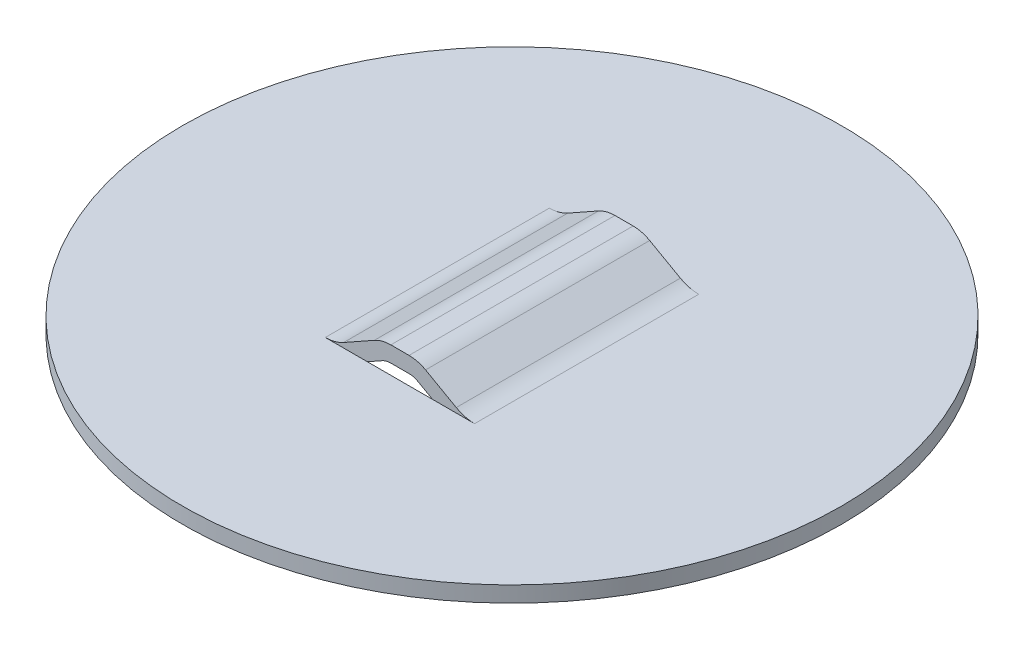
from build123d import *

# Parameters (mm, degrees)
BOSS_EXTRUDE1_DEPTH = 10.795
BOSS_EXTRUDE2_START = -0.762
SKETCH2_R           = 15.875
BOSS_EXTRUDE2_DEPTH = 0.762
CUT_EXTRUDE1_START  = -10.795
CUT_EXTRUDE1_DEPTH  = 10.795


with BuildPart() as part:
    # Sketch1 → Boss-Extrude1 (new body)
    with BuildSketch(Plane.XY):
        with BuildLine():
            Line((0, 0.508), (0.438235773, 0.508))
            ThreePointArc((0.438235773, 0.508), (0.656850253, 0.479871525), (0.861223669, 0.397318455))
            Line((0.861223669, 0.397318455), (2.339565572, -0.433210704))
            ThreePointArc((2.339565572, -0.433210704), (2.946674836, -0.678441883), (3.59608844, -0.762))
            Line((3.59608844, -0.762), (6.414303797, -0.762))
            Line((6.414303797, -0.762), (6.414303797, 0))
            Line((6.414303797, 0), (3.59608844, 0))
            ThreePointArc((3.59608844, 0), (3.139569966, 0.058738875), (2.712790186, 0.231129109))
            Line((2.712790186, 0.231129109), (1.234448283, 1.061658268))
            ThreePointArc((1.234448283, 1.061658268), (0.849745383, 1.217052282), (0.438235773, 1.27))
            Line((0.438235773, 1.27), (0, 1.27))
            Line((0, 1.27), (-0.438235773, 1.27))
            ThreePointArc((-0.438235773, 1.27), (-0.849745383, 1.217052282), (-1.234448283, 1.061658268))
            Line((-1.234448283, 1.061658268), (-2.712790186, 0.231129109))
            ThreePointArc((-2.712790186, 0.231129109), (-3.139569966, 0.058738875), (-3.59608844, 0))
            Line((-3.59608844, 0), (-6.414303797, 0))
            Line((-6.414303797, 0), (-6.414303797, -0.762))
            Line((-6.414303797, -0.762), (-3.59608844, -0.762))
            ThreePointArc((-3.59608844, -0.762), (-2.946674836, -0.678441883), (-2.339565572, -0.433210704))
            Line((-2.339565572, -0.433210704), (-0.861223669, 0.397318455))
            ThreePointArc((-0.861223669, 0.397318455), (-0.656850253, 0.479871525), (-0.438235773, 0.508))
            Line((-0.438235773, 0.508), (0, 0.508))
        make_face()
    extrude(amount=BOSS_EXTRUDE1_DEPTH)

    # Sketch2 → Boss-Extrude2 (add)
    with BuildSketch(Plane.XZ.offset(0.762).offset(BOSS_EXTRUDE2_START)):
        with Locations((0, 5.3975)):
            Circle(SKETCH2_R)
    extrude(amount=BOSS_EXTRUDE2_DEPTH)

    # Sketch4 → Cut-Extrude1 (cut)
    with BuildSketch(Plane.XY.offset(10.795).offset(CUT_EXTRUDE1_START)):
        with BuildLine():
            Line((-3.59608844, -0.762), (3.59608844, -0.762))
            ThreePointArc((3.59608844, -0.762), (2.946674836, -0.678441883), (2.339565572, -0.433210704))
            Line((2.339565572, -0.433210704), (0.861223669, 0.397318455))
            ThreePointArc((0.861223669, 0.397318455), (0.656850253, 0.479871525), (0.438235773, 0.508))
            Line((0.438235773, 0.508), (-0.438235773, 0.508))
            ThreePointArc((-0.438235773, 0.508), (-0.656850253, 0.479871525), (-0.861223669, 0.397318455))
            Line((-0.861223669, 0.397318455), (-2.339565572, -0.433210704))
            ThreePointArc((-2.339565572, -0.433210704), (-2.946674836, -0.678441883), (-3.59608844, -0.762))
        make_face()
    extrude(amount=CUT_EXTRUDE1_DEPTH, mode=Mode.SUBTRACT)


solid = part.part
